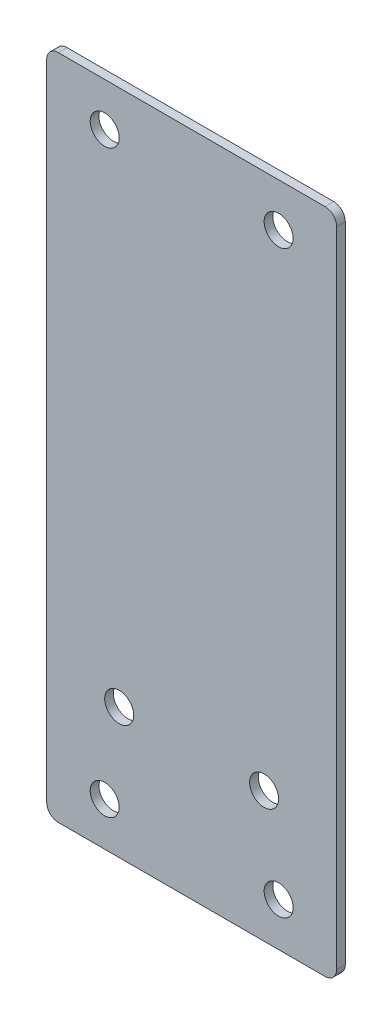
from build123d import *

# Parameters (mm, degrees)
ESQUISSE1_W             = 100
ESQUISSE1_H             = 230
BOSS_EXTRU_1_DEPTH      = 3
ESQUISSE2_R             = 5
ENL_V_MAT_EXTRU_1_DEPTH = 3
CONG_1_R                = 4
ESQUISSE3_R             = 5
ENL_V_MAT_EXTRU_2_DEPTH = 10


with BuildPart() as part:
    # Esquisse1 → Boss.-Extru.1 (new body)
    with BuildSketch(Plane.XY):
        with Locations((50, 115)):
            Rectangle(ESQUISSE1_W, ESQUISSE1_H)
    extrude(amount=BOSS_EXTRU_1_DEPTH)

    # Esquisse2 → Enl_v. mat.-Extru.1 (cut)
    with BuildSketch(Plane.XY.offset(3)):
        with Locations((20, 215)):
            Circle(ESQUISSE2_R)
        with Locations((80, 215)):
            Circle(ESQUISSE2_R)
        with Locations((20, 15)):
            Circle(ESQUISSE2_R)
        with Locations((80, 15)):
            Circle(ESQUISSE2_R)
    extrude(amount=-ENL_V_MAT_EXTRU_1_DEPTH, mode=Mode.SUBTRACT)

    # Cong_1
    cong_1_edges = [part.edges().sort_by_distance(p)[0] for p in [
        (0, 230, 1.5),
        (100, 230, 1.5),
        (100, 0, 1.5),
        (0, 0, 1.5),
    ]]
    fillet(cong_1_edges, radius=CONG_1_R)

    # Esquisse3 → Enl_v. mat.-Extru.2 (cut)
    with BuildSketch(Plane.XY.offset(3)):
        with Locations((25, 45)):
            Circle(ESQUISSE3_R)
        with Locations((75, 45)):
            Circle(ESQUISSE3_R)
    extrude(amount=-ENL_V_MAT_EXTRU_2_DEPTH, mode=Mode.SUBTRACT)


solid = part.part
